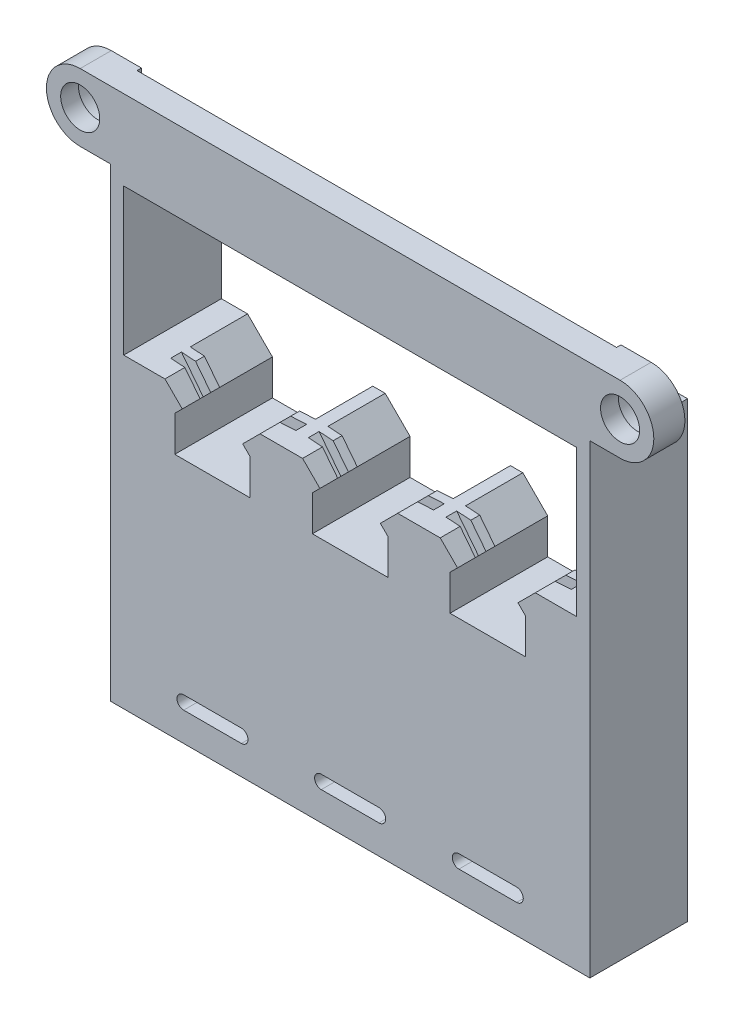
from build123d import *

# Parameters (mm, degrees)
SKETCH1_W              = 54
SKETCH1_H              = 60
BOSS_EXTRUDE1_DEPTH    = 11
CUT_EXTRUDE1_DEPTH     = 82.467785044
BOSS_EXTRUDE2_DEPTH    = 1.2
LPATTERN2_COUNT        = 3
LPATTERN2_PITCH        = 15.5
LPATTERN2_COPY_1_DEPTH = 1.2
LPATTERN2_COPY_2_DEPTH = 1.2
SKETCH7_W              = 45.103037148
SKETCH7_H              = 2.071479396
CUT_EXTRUDE3_DEPTH     = 82.467785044
BOSS_EXTRUDE3_DEPTH    = 3.5
SKETCH9_W              = 54
SKETCH9_H              = 9
CUT_EXTRUDE5_DEPTH     = 8
SKETCH14_R             = 2.2
CUT_EXTRUDE6_DEPTH     = 87.033075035
SKETCH15_R             = 2.6
CUT_EXTRUDE7_DEPTH     = 1.5


with BuildPart() as part:
    # Sketch1 → Boss-Extrude1 (new body)
    with BuildSketch(Plane.XY):
        with Locations((27, 30)):
            Rectangle(SKETCH1_W, SKETCH1_H)
    extrude(amount=BOSS_EXTRUDE1_DEPTH)

    # Sketch2 → Cut-Extrude1 (cut, through all)
    with BuildSketch(Plane.XY.offset(11)):
        Polygon((1.5, 51), (52.5, 51), (52.5, 34.5), (49.551518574, 34.5), (46.75, 31.698481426), (46.75, 27.698481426), (38.25, 27.698481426), (38.25, 31.698481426), (35.448481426, 34.5), (34.051518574, 34.5), (31.25, 31.698481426), (31.25, 27.698481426), (22.75, 27.698481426), (22.75, 31.698481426), (19.948481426, 34.5), (18.551518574, 34.5), (15.75, 31.698481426), (15.75, 27.698481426), (7.25, 27.698481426), (7.25, 31.698481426), (4.448481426, 34.5), (1.5, 34.5), align=None)
        with BuildLine():
            Line((8.25, 4.75), (14.75, 4.75))
            ThreePointArc((14.75, 4.75), (15.5, 4), (14.75, 3.25))
            Line((14.75, 3.25), (8.25, 3.25))
            ThreePointArc((8.25, 3.25), (7.5, 4), (8.25, 4.75))
        make_face()
        with BuildLine():
            Line((23.75, 4.75), (30.25, 4.75))
            ThreePointArc((30.25, 4.75), (31, 4), (30.25, 3.25))
            Line((30.25, 3.25), (23.75, 3.25))
            ThreePointArc((23.75, 3.25), (23, 4), (23.75, 4.75))
        make_face()
        with BuildLine():
            Line((39.25, 4.75), (45.75, 4.75))
            ThreePointArc((45.75, 4.75), (46.5, 4), (45.75, 3.25))
            Line((45.75, 3.25), (39.25, 3.25))
            ThreePointArc((39.25, 3.25), (38.5, 4), (39.25, 4.75))
        make_face()
    extrude(amount=-CUT_EXTRUDE1_DEPTH, mode=Mode.SUBTRACT)

    # Sketch3 → Boss-Extrude2 (add)
    with BuildSketch(Plane(origin=(19.474240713, 19.474240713, 0), x_dir=(0, 0, -1), z_dir=(0.7071067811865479, 0.7071067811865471, 0))):
        Polygon((-8.653374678, 21.249632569), (-9, 17.287687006), (-11, 17.287687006), (-11, 21.249632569), align=None)
        Polygon((-7.448790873, 21.249632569), (-7.795416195, 17.287687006), (-6.795416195, 17.287687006), (-6.448790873, 21.249632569), align=None)
    boss_extrude2 = extrude(amount=BOSS_EXTRUDE2_DEPTH)

    # Mirror1: Boss-Extrude2 across plane
    add(boss_extrude2.mirror(Plane(origin=(11.5, 0, 0), x_dir=(0, 0, 1), z_dir=(1, 0, 0))))

    # LPattern2: Boss-Extrude2 ×3
    with Locations(*[(i * LPATTERN2_PITCH, 0, 0) for i in range(1, LPATTERN2_COUNT)]):
        add(boss_extrude2)

    # LPattern2 copy 1 sketch → LPattern2 copy 1 (add)
    with BuildSketch(Plane(origin=(19.025759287, 19.474240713, 0), x_dir=(0, 0, -1), z_dir=(-0.7071067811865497, 0.7071067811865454, 0))):
        Polygon((-8.653374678, -21.249632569), (-9, -17.287687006), (-11, -17.287687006), (-11, -21.249632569), align=None)
        Polygon((-7.448790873, -21.249632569), (-7.795416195, -17.287687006), (-6.795416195, -17.287687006), (-6.448790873, -21.249632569), align=None)
    extrude(amount=LPATTERN2_COPY_1_DEPTH)

    # LPattern2 copy 2 sketch → LPattern2 copy 2 (add)
    with BuildSketch(Plane(origin=(34.525759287, 19.474240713, 0), x_dir=(0, 0, -1), z_dir=(-0.7071067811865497, 0.7071067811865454, 0))):
        Polygon((-8.653374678, -21.249632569), (-9, -17.287687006), (-11, -17.287687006), (-11, -21.249632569), align=None)
        Polygon((-7.448790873, -21.249632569), (-7.795416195, -17.287687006), (-6.795416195, -17.287687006), (-6.448790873, -21.249632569), align=None)
    extrude(amount=LPATTERN2_COPY_2_DEPTH)

    # Sketch7 → Cut-Extrude3 (cut, through all)
    with BuildSketch(Plane.XY):
        with Locations((27, 35.535739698)):
            Rectangle(SKETCH7_W, SKETCH7_H)
    extrude(amount=CUT_EXTRUDE3_DEPTH, mode=Mode.SUBTRACT)

    # Sketch12 → Boss-Extrude3 (add)
    with BuildSketch(Plane.XY.offset(11)):
        with BuildLine():
            Line((54, 60), (57.4, 60))
            ThreePointArc((57.4, 60), (61.2, 56.2), (57.4, 52.4))
            Line((57.4, 52.4), (54, 52.4))
            ThreePointArc((54, 52.4), (50.2, 56.2), (54, 60))
        make_face()
        with BuildLine():
            Line((0, 52.4), (-3.4, 52.4))
            ThreePointArc((-3.4, 52.4), (-7.2, 56.2), (-3.4, 60))
            Line((-3.4, 60), (0, 60))
            ThreePointArc((0, 60), (3.8, 56.2), (0, 52.4))
        make_face()
    extrude(amount=-BOSS_EXTRUDE3_DEPTH)

    # Sketch9 → Cut-Extrude5 (cut)
    with BuildSketch(Plane(origin=(0, 0, 0), x_dir=(-1, 0, 0), z_dir=(0, 0, -1))):
        with Locations((-27, 55.5)):
            Rectangle(SKETCH9_W, SKETCH9_H)
    extrude(amount=-CUT_EXTRUDE5_DEPTH, mode=Mode.SUBTRACT)

    # Sketch14 → Cut-Extrude6 (cut, through all)
    with BuildSketch(Plane(origin=(0, 0, 7.5), x_dir=(-1, 0, 0), z_dir=(0, 0, -1))):
        with Locations((-57.4, 56.2)):
            Circle(SKETCH14_R)
        with Locations((3.4, 56.2)):
            Circle(SKETCH14_R)
    extrude(amount=-CUT_EXTRUDE6_DEPTH, mode=Mode.SUBTRACT)

    # Sketch15 → Cut-Extrude7 (cut)
    with BuildSketch(Plane(origin=(0, 0, 7.5), x_dir=(-1, 0, 0), z_dir=(0, 0, -1))):
        with Locations((-57.4, 56.2)):
            Circle(SKETCH15_R)
        with Locations((3.4, 56.2)):
            Circle(SKETCH15_R)
    extrude(amount=-CUT_EXTRUDE7_DEPTH, mode=Mode.SUBTRACT)


solid = part.part
